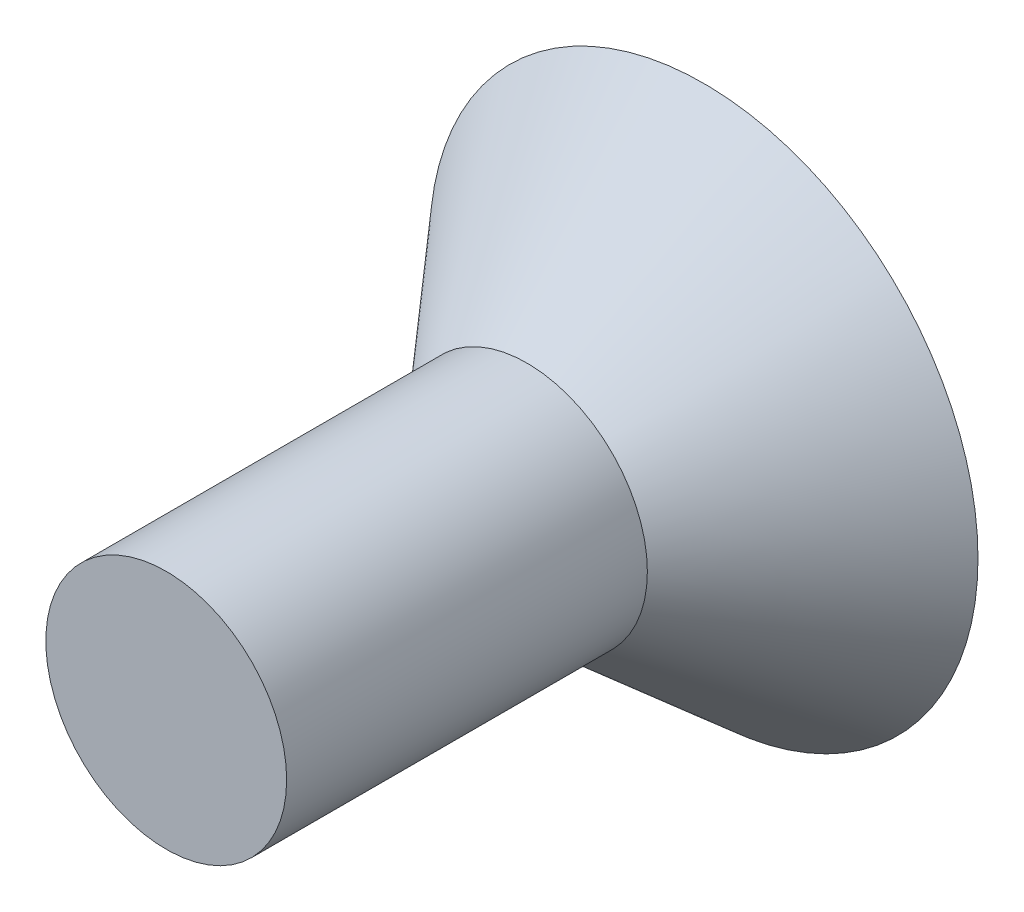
ISO-10303-21;
HEADER;
FILE_DESCRIPTION(('STEP AP214'),'2;1');
FILE_NAME('part.step','',(''),(''),'','','');
FILE_SCHEMA(('AUTOMOTIVE_DESIGN { 1 0 10303 214 1 1 1 1 }'));
ENDSEC;
DATA;
#1=APPLICATION_CONTEXT('core data for automotive mechanical design processes');
#2=APPLICATION_PROTOCOL_DEFINITION('international standard','automotive_design',2000,#1);
#3=PRODUCT_CONTEXT('',#1,'mechanical');
#4=PRODUCT('Part','Part','',(#3));
#5=PRODUCT_RELATED_PRODUCT_CATEGORY('part','',(#4));
#6=PRODUCT_DEFINITION_FORMATION('','',#4);
#7=PRODUCT_DEFINITION_CONTEXT('part definition',#1,'design');
#8=PRODUCT_DEFINITION('design','',#6,#7);
#9=PRODUCT_DEFINITION_SHAPE('','',#8);
#10=(LENGTH_UNIT() NAMED_UNIT(*) SI_UNIT(.MILLI.,.METRE.));
#11=(NAMED_UNIT(*) PLANE_ANGLE_UNIT() SI_UNIT($,.RADIAN.));
#12=(NAMED_UNIT(*) SI_UNIT($,.STERADIAN.) SOLID_ANGLE_UNIT());
#13=UNCERTAINTY_MEASURE_WITH_UNIT(LENGTH_MEASURE(1.E-05),#10,'distance_accuracy_value','');
#14=(GEOMETRIC_REPRESENTATION_CONTEXT(3) GLOBAL_UNCERTAINTY_ASSIGNED_CONTEXT((#13)) GLOBAL_UNIT_ASSIGNED_CONTEXT((#10,
#11,#12)) REPRESENTATION_CONTEXT('',''));
#15=CARTESIAN_POINT('',(0.,0.,0.));
#16=DIRECTION('',(0.,0.,1.));
#17=DIRECTION('',(1.,0.,0.));
#18=AXIS2_PLACEMENT_3D('',#15,#16,#17);
#19=CARTESIAN_POINT('',(0.,0.,6.35));
#20=DIRECTION('',(0.,0.,1.));
#21=DIRECTION('',(1.,0.,0.));
#22=AXIS2_PLACEMENT_3D('',#19,#20,#21);
#23=PLANE('',#22);
#24=CARTESIAN_POINT('',(0.,0.,6.35));
#25=DIRECTION('',(0.,0.,1.));
#26=DIRECTION('',(1.,0.,0.));
#27=AXIS2_PLACEMENT_3D('',#24,#25,#26);
#28=CIRCLE('',#27,1.4224);
#29=CARTESIAN_POINT('',(1.4224,0.,6.35));
#30=VERTEX_POINT('',#29);
#31=EDGE_CURVE('E11',#30,#30,#28,.T.);
#32=ORIENTED_EDGE('',*,*,#31,.T.);
#33=EDGE_LOOP('',(#32));
#34=FACE_BOUND('',#33,.T.);
#35=ADVANCED_FACE('F37',(#34),#23,.T.);
#36=CARTESIAN_POINT('',(0.,0.,6.35));
#37=DIRECTION('',(0.,0.,1.));
#38=DIRECTION('',(1.,0.,0.));
#39=AXIS2_PLACEMENT_3D('',#36,#37,#38);
#40=CYLINDRICAL_SURFACE('',#39,1.4224);
#41=CARTESIAN_POINT('',(0.,0.,2.08918406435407));
#42=DIRECTION('',(0.,0.,1.));
#43=DIRECTION('',(1.,0.,0.));
#44=AXIS2_PLACEMENT_3D('',#41,#42,#43);
#45=CIRCLE('',#44,1.4224);
#46=CARTESIAN_POINT('',(1.4224,0.,2.08918406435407));
#47=VERTEX_POINT('',#46);
#48=EDGE_CURVE('E44',#47,#47,#45,.T.);
#49=ORIENTED_EDGE('',*,*,#48,.T.);
#50=EDGE_LOOP('',(#49));
#51=FACE_BOUND('',#50,.T.);
#52=ORIENTED_EDGE('',*,*,#31,.F.);
#53=EDGE_LOOP('',(#52));
#54=FACE_BOUND('',#53,.T.);
#55=ADVANCED_FACE('F148',(#51,#54),#40,.T.);
#56=CARTESIAN_POINT('',(0.,0.,2.08918406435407));
#57=DIRECTION('',(0.,0.,-1.));
#58=DIRECTION('',(-1.,0.,0.));
#59=AXIS2_PLACEMENT_3D('',#56,#57,#58);
#60=CONICAL_SURFACE('',#59,1.4224,0.715584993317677);
#61=CARTESIAN_POINT('',(0.,0.,0.));
#62=DIRECTION('',(0.,0.,1.));
#63=DIRECTION('',(1.,0.,0.));
#64=AXIS2_PLACEMENT_3D('',#61,#62,#63);
#65=CIRCLE('',#64,3.2385);
#66=CARTESIAN_POINT('',(3.2385,0.,0.));
#67=VERTEX_POINT('',#66);
#68=EDGE_CURVE('E138',#67,#67,#65,.T.);
#69=ORIENTED_EDGE('',*,*,#68,.T.);
#70=EDGE_LOOP('',(#69));
#71=FACE_BOUND('',#70,.T.);
#72=ORIENTED_EDGE('',*,*,#48,.F.);
#73=EDGE_LOOP('',(#72));
#74=FACE_BOUND('',#73,.T.);
#75=ADVANCED_FACE('F151',(#71,#74),#60,.T.);
#76=CARTESIAN_POINT('',(0.,-3.2385,0.));
#77=DIRECTION('',(0.,0.,-1.));
#78=DIRECTION('',(-1.,0.,0.));
#79=AXIS2_PLACEMENT_3D('',#76,#77,#78);
#80=PLANE('',#79);
#81=DIRECTION('',(0.866025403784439,-0.5,0.));
#82=VECTOR('',#81,1.);
#83=CARTESIAN_POINT('',(0.,0.92387590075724,0.));
#84=LINE('',#83,#82);
#85=CARTESIAN_POINT('',(0.,0.92387590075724,0.));
#86=VERTEX_POINT('',#85);
#87=CARTESIAN_POINT('',(0.800100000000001,0.46193795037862,0.));
#88=VERTEX_POINT('',#87);
#89=EDGE_CURVE('E51',#86,#88,#84,.T.);
#90=ORIENTED_EDGE('',*,*,#89,.F.);
#91=DIRECTION('',(0.866025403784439,0.5,0.));
#92=VECTOR('',#91,1.);
#93=CARTESIAN_POINT('',(-0.800099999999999,0.461937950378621,0.));
#94=LINE('',#93,#92);
#95=CARTESIAN_POINT('',(-0.800099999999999,0.461937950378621,0.));
#96=VERTEX_POINT('',#95);
#97=EDGE_CURVE('E134',#96,#86,#94,.T.);
#98=ORIENTED_EDGE('',*,*,#97,.F.);
#99=DIRECTION('',(0.,1.,0.));
#100=VECTOR('',#99,1.);
#101=CARTESIAN_POINT('',(-0.8001,-0.461937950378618,0.));
#102=LINE('',#101,#100);
#103=CARTESIAN_POINT('',(-0.8001,-0.461937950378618,0.));
#104=VERTEX_POINT('',#103);
#105=EDGE_CURVE('E132',#104,#96,#102,.T.);
#106=ORIENTED_EDGE('',*,*,#105,.F.);
#107=DIRECTION('',(-0.866025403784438,0.5,0.));
#108=VECTOR('',#107,1.);
#109=CARTESIAN_POINT('',(0.,-0.923875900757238,0.));
#110=LINE('',#109,#108);
#111=CARTESIAN_POINT('',(0.,-0.923875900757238,0.));
#112=VERTEX_POINT('',#111);
#113=EDGE_CURVE('E99',#112,#104,#110,.T.);
#114=ORIENTED_EDGE('',*,*,#113,.F.);
#115=DIRECTION('',(-0.866025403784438,-0.5,0.));
#116=VECTOR('',#115,1.);
#117=CARTESIAN_POINT('',(0.800100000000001,-0.461937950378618,0.));
#118=LINE('',#117,#116);
#119=CARTESIAN_POINT('',(0.800100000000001,-0.461937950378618,0.));
#120=VERTEX_POINT('',#119);
#121=EDGE_CURVE('E128',#120,#112,#118,.T.);
#122=ORIENTED_EDGE('',*,*,#121,.F.);
#123=DIRECTION('',(0.,-1.,0.));
#124=VECTOR('',#123,1.);
#125=CARTESIAN_POINT('',(0.800100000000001,0.46193795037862,0.));
#126=LINE('',#125,#124);
#127=EDGE_CURVE('E125',#88,#120,#126,.T.);
#128=ORIENTED_EDGE('',*,*,#127,.F.);
#129=EDGE_LOOP('',(#90,#98,#106,#114,#122,#128));
#130=FACE_BOUND('',#129,.T.);
#131=ORIENTED_EDGE('',*,*,#68,.F.);
#132=EDGE_LOOP('',(#131));
#133=FACE_BOUND('',#132,.T.);
#134=ADVANCED_FACE('F153',(#130,#133),#80,.T.);
#135=CARTESIAN_POINT('',(0.,0.92387590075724,1.778));
#136=DIRECTION('',(0.5,0.866025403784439,0.));
#137=DIRECTION('',(-0.866025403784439,0.5,0.));
#138=AXIS2_PLACEMENT_3D('',#135,#136,#137);
#139=PLANE('',#138);
#140=ORIENTED_EDGE('',*,*,#89,.T.);
#141=DIRECTION('',(0.,0.,-1.));
#142=VECTOR('',#141,1.);
#143=CARTESIAN_POINT('',(0.800100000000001,0.46193795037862,1.778));
#144=LINE('',#143,#142);
#145=CARTESIAN_POINT('',(0.800100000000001,0.46193795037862,1.778));
#146=VERTEX_POINT('',#145);
#147=EDGE_CURVE('E81',#146,#88,#144,.T.);
#148=ORIENTED_EDGE('',*,*,#147,.F.);
#149=DIRECTION('',(0.866025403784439,-0.5,0.));
#150=VECTOR('',#149,1.);
#151=CARTESIAN_POINT('',(0.,0.92387590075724,1.778));
#152=LINE('',#151,#150);
#153=CARTESIAN_POINT('',(0.,0.92387590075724,1.778));
#154=VERTEX_POINT('',#153);
#155=EDGE_CURVE('E136',#154,#146,#152,.T.);
#156=ORIENTED_EDGE('',*,*,#155,.F.);
#157=DIRECTION('',(0.,0.,-1.));
#158=VECTOR('',#157,1.);
#159=CARTESIAN_POINT('',(0.,0.92387590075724,1.778));
#160=LINE('',#159,#158);
#161=EDGE_CURVE('E59',#154,#86,#160,.T.);
#162=ORIENTED_EDGE('',*,*,#161,.T.);
#163=EDGE_LOOP('',(#140,#148,#156,#162));
#164=FACE_BOUND('',#163,.T.);
#165=ADVANCED_FACE('F160',(#164),#139,.F.);
#166=CARTESIAN_POINT('',(-0.800099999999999,0.461937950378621,1.778));
#167=DIRECTION('',(-0.5,0.866025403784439,0.));
#168=DIRECTION('',(-0.866025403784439,-0.5,0.));
#169=AXIS2_PLACEMENT_3D('',#166,#167,#168);
#170=PLANE('',#169);
#171=ORIENTED_EDGE('',*,*,#97,.T.);
#172=ORIENTED_EDGE('',*,*,#161,.F.);
#173=DIRECTION('',(0.866025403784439,0.5,0.));
#174=VECTOR('',#173,1.);
#175=CARTESIAN_POINT('',(-0.800099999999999,0.461937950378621,1.778));
#176=LINE('',#175,#174);
#177=CARTESIAN_POINT('',(-0.800099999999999,0.461937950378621,1.778));
#178=VERTEX_POINT('',#177);
#179=EDGE_CURVE('E111',#178,#154,#176,.T.);
#180=ORIENTED_EDGE('',*,*,#179,.F.);
#181=DIRECTION('',(0.,0.,-1.));
#182=VECTOR('',#181,1.);
#183=CARTESIAN_POINT('',(-0.800099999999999,0.461937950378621,1.778));
#184=LINE('',#183,#182);
#185=EDGE_CURVE('E103',#178,#96,#184,.T.);
#186=ORIENTED_EDGE('',*,*,#185,.T.);
#187=EDGE_LOOP('',(#171,#172,#180,#186));
#188=FACE_BOUND('',#187,.T.);
#189=ADVANCED_FACE('F194',(#188),#170,.F.);
#190=CARTESIAN_POINT('',(-0.8001,-0.461937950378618,1.778));
#191=DIRECTION('',(-1.,0.,0.));
#192=DIRECTION('',(0.,-1.,0.));
#193=AXIS2_PLACEMENT_3D('',#190,#191,#192);
#194=PLANE('',#193);
#195=ORIENTED_EDGE('',*,*,#105,.T.);
#196=ORIENTED_EDGE('',*,*,#185,.F.);
#197=DIRECTION('',(0.,1.,0.));
#198=VECTOR('',#197,1.);
#199=CARTESIAN_POINT('',(-0.8001,-0.461937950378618,1.778));
#200=LINE('',#199,#198);
#201=CARTESIAN_POINT('',(-0.8001,-0.461937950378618,1.778));
#202=VERTEX_POINT('',#201);
#203=EDGE_CURVE('E107',#202,#178,#200,.T.);
#204=ORIENTED_EDGE('',*,*,#203,.F.);
#205=DIRECTION('',(0.,0.,-1.));
#206=VECTOR('',#205,1.);
#207=CARTESIAN_POINT('',(-0.8001,-0.461937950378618,1.778));
#208=LINE('',#207,#206);
#209=EDGE_CURVE('E92',#202,#104,#208,.T.);
#210=ORIENTED_EDGE('',*,*,#209,.T.);
#211=EDGE_LOOP('',(#195,#196,#204,#210));
#212=FACE_BOUND('',#211,.T.);
#213=ADVANCED_FACE('F108',(#212),#194,.F.);
#214=CARTESIAN_POINT('',(0.,-0.923875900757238,1.778));
#215=DIRECTION('',(-0.5,-0.866025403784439,0.));
#216=DIRECTION('',(0.866025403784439,-0.5,0.));
#217=AXIS2_PLACEMENT_3D('',#214,#215,#216);
#218=PLANE('',#217);
#219=ORIENTED_EDGE('',*,*,#113,.T.);
#220=ORIENTED_EDGE('',*,*,#209,.F.);
#221=DIRECTION('',(-0.866025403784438,0.5,0.));
#222=VECTOR('',#221,1.);
#223=CARTESIAN_POINT('',(0.,-0.923875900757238,1.778));
#224=LINE('',#223,#222);
#225=CARTESIAN_POINT('',(0.,-0.923875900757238,1.778));
#226=VERTEX_POINT('',#225);
#227=EDGE_CURVE('E96',#226,#202,#224,.T.);
#228=ORIENTED_EDGE('',*,*,#227,.F.);
#229=DIRECTION('',(0.,0.,-1.));
#230=VECTOR('',#229,1.);
#231=CARTESIAN_POINT('',(0.,-0.923875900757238,1.778));
#232=LINE('',#231,#230);
#233=EDGE_CURVE('E104',#226,#112,#232,.T.);
#234=ORIENTED_EDGE('',*,*,#233,.T.);
#235=EDGE_LOOP('',(#219,#220,#228,#234));
#236=FACE_BOUND('',#235,.T.);
#237=ADVANCED_FACE('F94',(#236),#218,.F.);
#238=CARTESIAN_POINT('',(0.800100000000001,-0.461937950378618,1.778));
#239=DIRECTION('',(0.5,-0.866025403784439,0.));
#240=DIRECTION('',(0.866025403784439,0.5,0.));
#241=AXIS2_PLACEMENT_3D('',#238,#239,#240);
#242=PLANE('',#241);
#243=ORIENTED_EDGE('',*,*,#121,.T.);
#244=ORIENTED_EDGE('',*,*,#233,.F.);
#245=DIRECTION('',(-0.866025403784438,-0.5,0.));
#246=VECTOR('',#245,1.);
#247=CARTESIAN_POINT('',(0.800100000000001,-0.461937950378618,1.778));
#248=LINE('',#247,#246);
#249=CARTESIAN_POINT('',(0.800100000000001,-0.461937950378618,1.778));
#250=VERTEX_POINT('',#249);
#251=EDGE_CURVE('E117',#250,#226,#248,.T.);
#252=ORIENTED_EDGE('',*,*,#251,.F.);
#253=DIRECTION('',(0.,0.,-1.));
#254=VECTOR('',#253,1.);
#255=CARTESIAN_POINT('',(0.800100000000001,-0.461937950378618,1.778));
#256=LINE('',#255,#254);
#257=EDGE_CURVE('E141',#250,#120,#256,.T.);
#258=ORIENTED_EDGE('',*,*,#257,.T.);
#259=EDGE_LOOP('',(#243,#244,#252,#258));
#260=FACE_BOUND('',#259,.T.);
#261=ADVANCED_FACE('F222',(#260),#242,.F.);
#262=CARTESIAN_POINT('',(0.800100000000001,0.46193795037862,1.778));
#263=DIRECTION('',(1.,0.,0.));
#264=DIRECTION('',(0.,0.,-1.));
#265=AXIS2_PLACEMENT_3D('',#262,#263,#264);
#266=PLANE('',#265);
#267=ORIENTED_EDGE('',*,*,#127,.T.);
#268=ORIENTED_EDGE('',*,*,#257,.F.);
#269=DIRECTION('',(0.,-1.,0.));
#270=VECTOR('',#269,1.);
#271=CARTESIAN_POINT('',(0.800100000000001,0.46193795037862,1.778));
#272=LINE('',#271,#270);
#273=EDGE_CURVE('E119',#146,#250,#272,.T.);
#274=ORIENTED_EDGE('',*,*,#273,.F.);
#275=ORIENTED_EDGE('',*,*,#147,.T.);
#276=EDGE_LOOP('',(#267,#268,#274,#275));
#277=FACE_BOUND('',#276,.T.);
#278=ADVANCED_FACE('F232',(#277),#266,.F.);
#279=CARTESIAN_POINT('',(-0.800099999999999,1.38581385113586,1.778));
#280=DIRECTION('',(0.,0.,1.));
#281=DIRECTION('',(1.,0.,0.));
#282=AXIS2_PLACEMENT_3D('',#279,#280,#281);
#283=PLANE('',#282);
#284=ORIENTED_EDGE('',*,*,#155,.T.);
#285=ORIENTED_EDGE('',*,*,#273,.T.);
#286=ORIENTED_EDGE('',*,*,#251,.T.);
#287=ORIENTED_EDGE('',*,*,#227,.T.);
#288=ORIENTED_EDGE('',*,*,#203,.T.);
#289=ORIENTED_EDGE('',*,*,#179,.T.);
#290=EDGE_LOOP('',(#284,#285,#286,#287,#288,#289));
#291=FACE_BOUND('',#290,.T.);
#292=ADVANCED_FACE('F114',(#291),#283,.F.);
#293=CLOSED_SHELL('',(#35,#55,#75,#134,#165,#189,#213,#237,#261,#278,#292));
#294=MANIFOLD_SOLID_BREP('B2',#293);
#295=ADVANCED_BREP_SHAPE_REPRESENTATION('',(#18,#294),#14);
#296=SHAPE_DEFINITION_REPRESENTATION(#9,#295);
ENDSEC;
END-ISO-10303-21;
